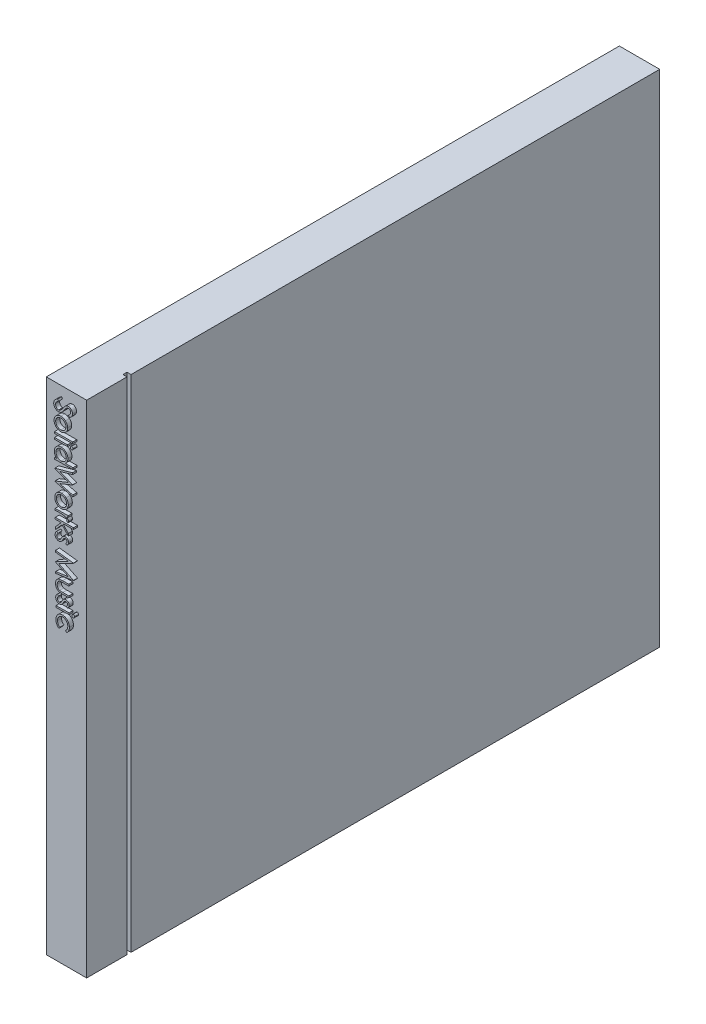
from build123d import *

# Parameters (mm, degrees)
SKETCH1_W           = 142
SKETCH1_H           = 124
BASE_EXTRUDE_DEPTH  = 10
SKETCH2_W           = 0.396761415
SKETCH2_H           = 4.534416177
SKETCH2_W_2         = 0.396761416
SKETCH2_H_2         = 3.230771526
BOSS_EXTRUDE1_DEPTH = 1
SKETCH3_W           = 1
SKETCH3_H           = 124
CUT_EXTRUDE1_DEPTH  = 1


with BuildPart() as part:
    # Sketch1 → Base-Extrude (new body)
    with BuildSketch(Plane(origin=(0, 0, 0), x_dir=(0, 0, -1), z_dir=(1, 0, 0))):
        with Locations((71, 62)):
            Rectangle(SKETCH1_W, SKETCH1_H)
    extrude(amount=BASE_EXTRUDE_DEPTH)

    # Sketch2 → Boss-Extrude1 (add)
    # profile 1 of 17: a face of its own
    with BuildSketch(Plane(origin=(0, 11.766022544, 0), x_dir=(0.010471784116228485, -0.9999451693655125, 0), z_dir=(0, 0, 1))):
        with BuildLine():
            Line((-109.824285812, 4.943446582), (-109.450550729, 5.167510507))
            add(Edge.make_bspline(
                [(-109.450550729, 5.167510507), (-109.415790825, 5.109323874), (-109.349192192, 4.997840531), (-109.238095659, 4.847198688), (-109.122980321, 4.719162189), (-109.00299371, 4.614475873), (-108.878868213, 4.532056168), (-108.749793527, 4.473695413), (-108.616204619, 4.437296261), (-108.525290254, 4.432875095), (-108.479902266, 4.430667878)],
                knots=[0, 0, 0, 0, 1.272034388, 2.437168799, 3.508375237, 4.49857839, 5.41946034, 6.295179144, 7.148887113, 8, 8, 8, 8], degree=3))
            add(Edge.make_bspline(
                [(-108.479902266, 4.430667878), (-108.441139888, 4.431747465), (-108.364293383, 4.433887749), (-108.251162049, 4.454452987), (-108.14129022, 4.486047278), (-108.036942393, 4.531294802), (-107.93955839, 4.586038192), (-107.854160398, 4.652159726), (-107.780333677, 4.72618867), (-107.719943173, 4.808777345), (-107.673610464, 4.89759907), (-107.637999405, 4.988768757), (-107.618237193, 5.083718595), (-107.615260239, 5.147647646), (-107.613757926, 5.179909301)],
                knots=[0, 0, 0, 0, 1.095163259, 2.171163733, 3.241058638, 4.321873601, 5.38011039, 6.391990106, 7.366004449, 8.327778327, 9.272591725, 10.192022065, 11.087607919, 12, 12, 12, 12], degree=3))
            add(Edge.make_bspline(
                [(-107.613757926, 5.179909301), (-107.615620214, 5.216718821), (-107.619405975, 5.291547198), (-107.651403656, 5.401946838), (-107.701739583, 5.511200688), (-107.74817664, 5.578781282), (-107.772285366, 5.613867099)],
                knots=[0, 0, 0, 0, 0.938893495, 1.908633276, 2.914225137, 4, 4, 4, 4], degree=3))
            add(Edge.make_bspline(
                [(-107.772285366, 5.613867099), (-107.79207984, 5.639189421), (-107.833635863, 5.692350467), (-107.905076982, 5.771481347), (-107.988907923, 5.853104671), (-108.082259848, 5.940337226), (-108.188533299, 6.029121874), (-108.304399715, 6.123692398), (-108.432817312, 6.220452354), (-108.522879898, 6.285344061), (-108.56935071, 6.318827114)],
                knots=[0, 0, 0, 0, 0.722233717, 1.516239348, 2.393582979, 3.351407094, 4.387010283, 5.505090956, 6.712668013, 8, 8, 8, 8], degree=3))
            add(Edge.make_bspline(
                [(-108.56935071, 6.318827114), (-108.615865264, 6.351957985), (-108.704797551, 6.415301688), (-108.829166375, 6.509311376), (-108.940380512, 6.595261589), (-109.037945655, 6.673961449), (-109.12181889, 6.745421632), (-109.192661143, 6.808955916), (-109.248667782, 6.86628256), (-109.279811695, 6.90347165), (-109.293794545, 6.920168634)],
                knots=[0, 0, 0, 0, 1.452282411, 2.77665338, 3.964542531, 5.026858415, 5.96415736, 6.766646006, 7.446254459, 8, 8, 8, 8], degree=3))
            add(Edge.make_bspline(
                [(-109.293794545, 6.920168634), (-109.313338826, 6.946191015), (-109.351775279, 6.99736752), (-109.402511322, 7.07735687), (-109.445634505, 7.159238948), (-109.47943958, 7.243233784), (-109.507906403, 7.328162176), (-109.527053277, 7.415132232), (-109.539042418, 7.503753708), (-109.540270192, 7.563391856), (-109.540884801, 7.593246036)],
                knots=[0, 0, 0, 0, 1.068054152, 2.10047183, 3.106115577, 4.101338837, 5.06977816, 6.043150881, 7.020423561, 8, 8, 8, 8], degree=3))
            add(Edge.make_bspline(
                [(-109.540884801, 7.593246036), (-109.539236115, 7.640020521), (-109.535973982, 7.73256972), (-109.50838594, 7.867766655), (-109.464841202, 7.996844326), (-109.40383709, 8.118524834), (-109.325196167, 8.229639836), (-109.234190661, 8.331467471), (-109.125797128, 8.417069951), (-109.006867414, 8.491864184), (-108.876690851, 8.550406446), (-108.740281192, 8.594567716), (-108.597421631, 8.619589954), (-108.500659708, 8.623180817), (-108.451562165, 8.625002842)],
                knots=[0, 0, 0, 0, 1.005424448, 1.989358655, 2.955360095, 3.929531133, 4.905563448, 5.876582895, 6.856512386, 7.866279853, 8.892233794, 9.918561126, 10.94386622, 12, 12, 12, 12], degree=3))
            add(Edge.make_bspline(
                [(-108.451562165, 8.625002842), (-108.399464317, 8.623205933), (-108.295858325, 8.619632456), (-108.143459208, 8.588561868), (-107.996729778, 8.537150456), (-107.878696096, 8.478806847), (-107.786317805, 8.420535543), (-107.715867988, 8.367457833), (-107.644477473, 8.306352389), (-107.571570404, 8.23705645), (-107.498382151, 8.158934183), (-107.423826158, 8.07252062), (-107.347728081, 7.97834385), (-107.298773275, 7.911112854), (-107.273676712, 7.876647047)],
                knots=[0, 0, 0, 0, 1.286793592, 2.559021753, 3.825965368, 5.121522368, 5.803751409, 6.523245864, 7.299691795, 8.125521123, 9.008227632, 9.944561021, 10.946284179, 12, 12, 12, 12], degree=3))
            Line((-107.273676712, 7.876647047), (-107.632356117, 7.604759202))
            add(Edge.make_bspline(
                [(-107.632356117, 7.604759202), (-107.654014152, 7.632660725), (-107.695722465, 7.686392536), (-107.759043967, 7.761640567), (-107.818726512, 7.830377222), (-107.877527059, 7.890080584), (-107.932340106, 7.944020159), (-107.985540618, 7.990200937), (-108.036362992, 8.029075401), (-108.100426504, 8.070562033), (-108.1809121, 8.111686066), (-108.28194527, 8.146484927), (-108.387528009, 8.167396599), (-108.459439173, 8.170161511), (-108.495843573, 8.171561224)],
                knots=[0, 0, 0, 0, 1.181633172, 2.275549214, 3.290209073, 4.226197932, 5.078386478, 5.862611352, 6.581680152, 7.217281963, 8.414376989, 9.595101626, 10.782541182, 12, 12, 12, 12], degree=3))
            add(Edge.make_bspline(
                [(-108.495843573, 8.171561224), (-108.541515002, 8.170030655), (-108.629588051, 8.167079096), (-108.754628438, 8.134843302), (-108.867168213, 8.084087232), (-108.963866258, 8.012952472), (-109.044376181, 7.928673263), (-109.102614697, 7.831689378), (-109.137667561, 7.72459574), (-109.14194497, 7.649890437), (-109.144123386, 7.611844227)],
                knots=[0, 0, 0, 0, 1.14458467, 2.207223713, 3.21896685, 4.227309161, 5.202851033, 6.127160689, 7.046193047, 8, 8, 8, 8], degree=3))
            add(Edge.make_bspline(
                [(-109.144123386, 7.611844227), (-109.143626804, 7.588158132), (-109.142632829, 7.540747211), (-109.128769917, 7.47070326), (-109.110960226, 7.400836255), (-109.082737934, 7.331460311), (-109.043775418, 7.261362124), (-108.992610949, 7.189334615), (-108.928173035, 7.11474293), (-108.878812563, 7.066228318), (-108.852751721, 7.040614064)],
                knots=[0, 0, 0, 0, 0.858281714, 1.717966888, 2.583508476, 3.4729293, 4.427298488, 5.488583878, 6.674047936, 8, 8, 8, 8], degree=3))
            add(Edge.make_bspline(
                [(-108.852751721, 7.040614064), (-108.843074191, 7.031977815), (-108.820082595, 7.011460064), (-108.778049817, 6.97786979), (-108.722543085, 6.93643468), (-108.655011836, 6.885166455), (-108.5742109, 6.825695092), (-108.480131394, 6.758781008), (-108.373822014, 6.682251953), (-108.298383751, 6.628747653), (-108.258495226, 6.600456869)],
                knots=[0, 0, 0, 0, 0.420754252, 0.999615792, 1.744751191, 2.668019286, 3.750313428, 4.999500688, 6.413464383, 8, 8, 8, 8], degree=3))
            add(Edge.make_bspline(
                [(-108.258495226, 6.600456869), (-108.210512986, 6.565541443), (-108.117602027, 6.497932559), (-107.985402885, 6.396354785), (-107.865536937, 6.297010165), (-107.75758334, 6.200533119), (-107.660475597, 6.107655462), (-107.575291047, 6.017259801), (-107.501161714, 5.929993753), (-107.421356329, 5.818112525), (-107.339809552, 5.680704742), (-107.269778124, 5.512353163), (-107.22562018, 5.343347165), (-107.21984563, 5.229755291), (-107.21699651, 5.173709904)],
                knots=[0, 0, 0, 0, 1.163667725, 2.253281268, 3.268753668, 4.215851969, 5.092017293, 5.902905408, 6.650798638, 7.335211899, 8.59617414, 9.77448103, 10.901945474, 12, 12, 12, 12], degree=3))
            add(Edge.make_bspline(
                [(-107.21699651, 5.173709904), (-107.21782658, 5.134074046), (-107.2194706, 5.055572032), (-107.23836861, 4.940302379), (-107.266056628, 4.828347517), (-107.3077879, 4.721091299), (-107.358722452, 4.616571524), (-107.423353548, 4.517529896), (-107.498268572, 4.421774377), (-107.58420602, 4.331858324), (-107.678243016, 4.249315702), (-107.777633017, 4.175889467), (-107.882538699, 4.114666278), (-107.992390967, 4.064707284), (-108.107215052, 4.025633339), (-108.226972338, 3.997322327), (-108.351860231, 3.979946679), (-108.43674511, 3.97814319), (-108.479902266, 3.97722626)],
                knots=[0, 0, 0, 0, 0.983748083, 1.948392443, 2.894712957, 3.844097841, 4.80183111, 5.778335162, 6.776009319, 7.81870978, 8.863265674, 9.881300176, 10.883814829, 11.87499822, 12.874611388, 13.892143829, 14.928324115, 16, 16, 16, 16], degree=3))
            add(Edge.make_bspline(
                [(-108.479902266, 3.97722626), (-108.513294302, 3.977871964), (-108.579657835, 3.979155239), (-108.677817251, 3.990500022), (-108.773993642, 4.006551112), (-108.86698017, 4.032034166), (-108.95797486, 4.062952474), (-109.046581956, 4.101021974), (-109.132844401, 4.146643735), (-109.217245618, 4.198805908), (-109.29957095, 4.259510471), (-109.379048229, 4.330213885), (-109.458285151, 4.408966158), (-109.534942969, 4.49790588), (-109.610572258, 4.595596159), (-109.68368188, 4.702950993), (-109.755785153, 4.819385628), (-109.801025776, 4.901320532), (-109.824285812, 4.943446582)],
                knots=[0, 0, 0, 0, 0.915332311, 1.819136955, 2.706846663, 3.586547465, 4.459518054, 5.340707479, 6.227863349, 7.133153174, 8.059268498, 9.028702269, 10.047606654, 11.120612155, 12.245963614, 13.433783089, 14.680604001, 16, 16, 16, 16], degree=3))
        make_face()
    # profile 2 of 17: a face of its own
    with BuildSketch(Plane(origin=(0, 11.766022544, 0), x_dir=(0.010471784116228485, -0.9999451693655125, 0), z_dir=(0, 0, 1))):
        with BuildLine():
            add(Edge.make_bspline(
                [(-104.862996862, 7.378038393), (-104.802376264, 7.376747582), (-104.683514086, 7.374216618), (-104.509440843, 7.347166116), (-104.343278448, 7.305800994), (-104.184390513, 7.248615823), (-104.034811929, 7.171964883), (-103.89236394, 7.080500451), (-103.757437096, 6.972143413), (-103.676565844, 6.888322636), (-103.635516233, 6.845775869)],
                knots=[0, 0, 0, 0, 1.054011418, 2.066658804, 3.057071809, 4.030435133, 4.997543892, 5.974964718, 6.972108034, 8, 8, 8, 8], degree=3))
            add(Edge.make_bspline(
                [(-103.635516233, 6.845775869), (-103.600170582, 6.80508449), (-103.530163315, 6.724489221), (-103.440396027, 6.593808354), (-103.363063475, 6.458473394), (-103.301089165, 6.316687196), (-103.252223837, 6.169687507), (-103.217530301, 6.016969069), (-103.196894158, 5.85886915), (-103.194111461, 5.751495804), (-103.192702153, 5.697116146)],
                knots=[0, 0, 0, 0, 1.025258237, 2.030674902, 3.01204498, 3.988269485, 4.97094183, 5.956517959, 6.965070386, 8, 8, 8, 8], degree=3))
            add(Edge.make_bspline(
                [(-103.192702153, 5.697116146), (-103.193941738, 5.642421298), (-103.196391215, 5.534341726), (-103.219562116, 5.375159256), (-103.255601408, 5.220807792), (-103.307178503, 5.071933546), (-103.373315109, 4.928081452), (-103.454019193, 4.789879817), (-103.549857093, 4.657055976), (-103.658493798, 4.530737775), (-103.778559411, 4.41431721), (-103.90881148, 4.31284985), (-104.046690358, 4.225917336), (-104.194029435, 4.155892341), (-104.349483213, 4.100680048), (-104.513386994, 4.061901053), (-104.685486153, 4.038454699), (-104.802994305, 4.035443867), (-104.862996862, 4.033906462)],
                knots=[0, 0, 0, 0, 0.998656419, 1.973391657, 2.932242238, 3.890759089, 4.846373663, 5.82037756, 6.809684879, 7.83454468, 8.860553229, 9.859544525, 10.845671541, 11.83227036, 12.833544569, 13.85385346, 14.904124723, 16, 16, 16, 16], degree=3))
            add(Edge.make_bspline(
                [(-104.862996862, 4.033906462), (-104.923293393, 4.035449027), (-105.041387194, 4.038470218), (-105.21409382, 4.06180996), (-105.37829135, 4.100662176), (-105.533948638, 4.156073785), (-105.681921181, 4.225919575), (-105.82059896, 4.312587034), (-105.950956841, 4.414347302), (-106.071047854, 4.530729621), (-106.179677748, 4.657058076), (-106.275517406, 4.789879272), (-106.356221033, 4.928081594), (-106.422357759, 5.071933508), (-106.473934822, 5.220807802), (-106.509974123, 5.375159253), (-106.533145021, 5.534341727), (-106.535594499, 5.642421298), (-106.536834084, 5.697116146)],
                knots=[0, 0, 0, 0, 1.099876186, 2.154163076, 3.173186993, 4.173200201, 5.163417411, 6.152872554, 7.150605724, 8.17532212, 9.198891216, 10.186952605, 11.159729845, 12.11414092, 13.071450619, 14.029093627, 15.002601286, 16, 16, 16, 16], degree=3))
            add(Edge.make_bspline(
                [(-106.536834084, 5.697116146), (-106.535415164, 5.751200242), (-106.532605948, 5.858277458), (-106.511990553, 6.016080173), (-106.477432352, 6.168540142), (-106.428508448, 6.314972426), (-106.3659629, 6.456137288), (-106.289717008, 6.591806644), (-106.199034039, 6.72189659), (-106.129305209, 6.802387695), (-106.094020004, 6.843118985)],
                knots=[0, 0, 0, 0, 1.031353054, 2.041901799, 3.029428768, 4.008703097, 4.981709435, 5.96992636, 6.972712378, 8, 8, 8, 8], degree=3))
            add(Edge.make_bspline(
                [(-106.094020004, 6.843118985), (-106.053032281, 6.886034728), (-105.972422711, 6.970436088), (-105.836824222, 7.078477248), (-105.694726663, 7.171844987), (-105.54349507, 7.246972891), (-105.384737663, 7.306137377), (-105.217723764, 7.347272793), (-105.043059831, 7.374119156), (-104.923616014, 7.376718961), (-104.862996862, 7.378038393)],
                knots=[0, 0, 0, 0, 1.027980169, 2.021703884, 2.998553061, 3.971491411, 4.943284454, 5.930300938, 6.949603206, 8, 8, 8, 8], degree=3))
        make_face()
        with BuildLine():
            add(Edge.make_bspline(
                [(-104.864768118, 6.981276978), (-104.907636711, 6.980058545), (-104.992267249, 6.977653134), (-105.116839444, 6.959357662), (-105.236763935, 6.930371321), (-105.352268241, 6.88918722), (-105.462962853, 6.836009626), (-105.568953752, 6.770693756), (-105.670552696, 6.694104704), (-105.765772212, 6.60636232), (-105.853160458, 6.510515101), (-105.929553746, 6.408390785), (-105.994511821, 6.301645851), (-106.048625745, 6.190169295), (-106.08892959, 6.072831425), (-106.118200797, 5.950961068), (-106.136479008, 5.824309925), (-106.138861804, 5.738211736), (-106.140072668, 5.694459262)],
                knots=[0, 0, 0, 0, 1.021534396, 2.016698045, 2.994645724, 3.958388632, 4.93408049, 5.916473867, 6.921342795, 7.962252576, 8.998418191, 10.008913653, 10.997312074, 11.973003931, 12.956656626, 13.948281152, 14.957379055, 16, 16, 16, 16], degree=3))
            add(Edge.make_bspline(
                [(-106.140072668, 5.694459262), (-106.138042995, 5.637930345), (-106.134014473, 5.525731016), (-106.101254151, 5.360495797), (-106.04645039, 5.201865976), (-105.972445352, 5.050771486), (-105.879721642, 4.910974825), (-105.770474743, 4.786337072), (-105.645877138, 4.678733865), (-105.507414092, 4.589452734), (-105.357913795, 4.518514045), (-105.199695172, 4.468241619), (-105.03467523, 4.435561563), (-104.92189949, 4.432313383), (-104.864768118, 4.430667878)],
                knots=[0, 0, 0, 0, 1.016792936, 2.018143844, 3.017858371, 4.030088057, 5.03801393, 6.028138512, 7.003788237, 7.991172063, 8.984598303, 9.972568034, 10.972917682, 12, 12, 12, 12], degree=3))
            add(Edge.make_bspline(
                [(-104.864768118, 4.430667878), (-104.807640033, 4.43232297), (-104.694870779, 4.435590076), (-104.530080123, 4.468077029), (-104.372293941, 4.518734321), (-104.222948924, 4.589372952), (-104.084548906, 4.679072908), (-103.95905519, 4.78572946), (-103.850741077, 4.91130494), (-103.75810909, 5.050956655), (-103.682892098, 5.201631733), (-103.628344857, 5.360525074), (-103.595505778, 5.52572356), (-103.591487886, 5.637927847), (-103.589463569, 5.694459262)],
                knots=[0, 0, 0, 0, 1.02726834, 2.027799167, 3.010890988, 4.004497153, 4.992059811, 5.971914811, 6.958719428, 7.966827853, 8.981595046, 9.981490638, 10.983022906, 12, 12, 12, 12], degree=3))
            add(Edge.make_bspline(
                [(-103.589463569, 5.694459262), (-103.590674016, 5.738211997), (-103.593055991, 5.824310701), (-103.61134017, 5.950958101), (-103.640589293, 6.07284231), (-103.680974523, 6.190129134), (-103.734853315, 6.301934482), (-103.801064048, 6.408077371), (-103.877145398, 6.51086887), (-103.965588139, 6.606052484), (-104.060708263, 6.694138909), (-104.162348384, 6.770723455), (-104.268182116, 6.835722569), (-104.378555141, 6.889642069), (-104.494074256, 6.929996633), (-104.613830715, 6.959525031), (-104.737871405, 6.977575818), (-104.822198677, 6.980035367), (-104.864768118, 6.981276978)],
                knots=[0, 0, 0, 0, 1.042956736, 2.052379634, 3.044323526, 4.02829302, 5.004299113, 5.996692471, 7.007513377, 8.048758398, 9.090003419, 10.095195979, 11.07790575, 12.047570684, 13.018257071, 13.989683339, 14.985167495, 16, 16, 16, 16], degree=3))
        make_face(mode=Mode.SUBTRACT)
    # profile 3 of 17: a face of its own
    with BuildSketch(Plane(origin=(0, 11.766022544, 0), x_dir=(0.010471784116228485, -0.9999451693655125, 0), z_dir=(0, 0, 1))):
        with Locations((-102.257478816, 6.357794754)):
            Rectangle(SKETCH2_W, SKETCH2_H)
    # profile 4 of 17: a face of its own
    with BuildSketch(Plane(origin=(0, 11.766022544, 0), x_dir=(0.010471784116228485, -0.9999451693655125, 0), z_dir=(0, 0, 1))):
        with BuildLine():
            add(Edge.make_bspline(
                [(-101.012285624, 8.681683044), (-100.987664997, 8.680540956), (-100.939453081, 8.678304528), (-100.86973522, 8.659153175), (-100.806252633, 8.626690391), (-100.749943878, 8.583137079), (-100.701625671, 8.531916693), (-100.667797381, 8.472218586), (-100.646055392, 8.407723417), (-100.643429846, 8.362735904), (-100.642093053, 8.339830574)],
                knots=[0, 0, 0, 0, 1.055194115, 2.066272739, 3.074728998, 4.095836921, 5.109056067, 6.073838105, 7.019297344, 8, 8, 8, 8], degree=3))
            add(Edge.make_bspline(
                [(-100.642093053, 8.339830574), (-100.643459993, 8.317519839), (-100.646162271, 8.273414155), (-100.667780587, 8.210037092), (-100.701913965, 8.151168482), (-100.749912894, 8.100047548), (-100.806260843, 8.056518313), (-100.869733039, 8.024049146), (-100.939453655, 8.004899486), (-100.987665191, 8.002662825), (-101.012285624, 8.001520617)],
                knots=[0, 0, 0, 0, 0.96129708, 1.900370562, 2.859976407, 3.87933698, 4.906634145, 5.921202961, 6.938410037, 8, 8, 8, 8], degree=3))
            add(Edge.make_bspline(
                [(-101.012285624, 8.001520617), (-101.036624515, 8.002619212), (-101.083996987, 8.004757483), (-101.152670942, 8.024424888), (-101.215612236, 8.056529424), (-101.27203081, 8.099762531), (-101.319058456, 8.151482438), (-101.353287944, 8.210001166), (-101.374856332, 8.273423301), (-101.377565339, 8.317522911), (-101.378935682, 8.339830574)],
                knots=[0, 0, 0, 0, 1.054934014, 2.053291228, 3.073705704, 4.106921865, 5.123545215, 6.088680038, 7.033164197, 8, 8, 8, 8], degree=3))
            add(Edge.make_bspline(
                [(-101.378935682, 8.339830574), (-101.377595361, 8.362732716), (-101.374962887, 8.407713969), (-101.353271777, 8.472255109), (-101.319343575, 8.531600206), (-101.271999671, 8.583421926), (-101.215620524, 8.626679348), (-101.152668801, 8.658777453), (-101.083997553, 8.678446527), (-101.036624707, 8.680584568), (-101.012285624, 8.681683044)],
                knots=[0, 0, 0, 0, 0.98631895, 1.937192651, 2.907499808, 3.917963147, 4.944918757, 5.95915025, 6.951458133, 8, 8, 8, 8], degree=3))
        make_face()
    # profile 5 of 17: a face of its own
    with BuildSketch(Plane(origin=(0, 11.766022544, 0), x_dir=(0.010471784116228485, -0.9999451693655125, 0), z_dir=(0, 0, 1))):
        with Locations((-101.010514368, 5.705972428)):
            Rectangle(SKETCH2_W_2, SKETCH2_H_2)
    # profile 6 of 17: a face of its own
    with BuildSketch(Plane(origin=(0, 11.766022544, 0), x_dir=(0.010471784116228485, -0.9999451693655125, 0), z_dir=(0, 0, 1))):
        with BuildLine():
            Line((-96.561118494, 8.625002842), (-96.561118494, 4.090586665))
            Line((-96.561118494, 4.090586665), (-96.95787991, 4.090586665))
            Line((-96.95787991, 4.090586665), (-96.95787991, 4.649418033))
            add(Edge.make_bspline(
                [(-96.95787991, 4.649418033), (-97.002619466, 4.598841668), (-97.089929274, 4.500141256), (-97.235749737, 4.371195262), (-97.390320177, 4.264612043), (-97.552890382, 4.178527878), (-97.723313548, 4.113864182), (-97.901211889, 4.067902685), (-98.086657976, 4.038352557), (-98.213292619, 4.03540179), (-98.277465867, 4.033906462)],
                knots=[0, 0, 0, 0, 1.074387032, 2.096679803, 3.090159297, 4.057316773, 5.018401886, 5.985159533, 6.978961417, 8, 8, 8, 8], degree=3))
            add(Edge.make_bspline(
                [(-98.277465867, 4.033906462), (-98.334520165, 4.035455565), (-98.447033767, 4.038510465), (-98.612544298, 4.062210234), (-98.771818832, 4.100269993), (-98.925007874, 4.15319747), (-99.071120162, 4.223404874), (-99.211406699, 4.307457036), (-99.345140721, 4.407550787), (-99.470283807, 4.521977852), (-99.58552431, 4.646266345), (-99.68665441, 4.778829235), (-99.77097415, 4.919093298), (-99.841483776, 5.065282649), (-99.895794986, 5.218522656), (-99.933656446, 5.378283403), (-99.957328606, 5.544375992), (-99.960382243, 5.657478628), (-99.961930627, 5.714828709)],
                knots=[0, 0, 0, 0, 1.033919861, 2.038935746, 3.024066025, 3.998881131, 4.97069526, 5.957263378, 6.95902576, 7.993208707, 9.027059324, 10.027763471, 11.009749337, 11.988697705, 12.965288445, 13.950418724, 14.960734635, 16, 16, 16, 16], degree=3))
            add(Edge.make_bspline(
                [(-99.961930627, 5.714828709), (-99.960347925, 5.770993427), (-99.957219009, 5.882028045), (-99.933909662, 6.045327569), (-99.894712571, 6.202613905), (-99.839704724, 6.353380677), (-99.769167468, 6.497810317), (-99.683363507, 6.636004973), (-99.582286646, 6.768345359), (-99.465757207, 6.891719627), (-99.339523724, 7.00568259), (-99.20448102, 7.104725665), (-99.063988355, 7.190262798), (-98.915866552, 7.258035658), (-98.762307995, 7.31286825), (-98.601945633, 7.350804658), (-98.435446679, 7.373159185), (-98.322405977, 7.376396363), (-98.265067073, 7.378038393)],
                knots=[0, 0, 0, 0, 1.020392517, 2.01726096, 2.990465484, 3.961182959, 4.928053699, 5.906110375, 6.912531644, 7.948652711, 8.985773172, 9.998621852, 10.987621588, 11.969261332, 12.953316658, 13.946091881, 14.958173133, 16, 16, 16, 16], degree=3))
            add(Edge.make_bspline(
                [(-98.265067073, 7.378038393), (-98.199108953, 7.376058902), (-98.069640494, 7.372173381), (-97.880294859, 7.339702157), (-97.701194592, 7.285180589), (-97.531308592, 7.210538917), (-97.371649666, 7.113527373), (-97.221047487, 6.996367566), (-97.082121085, 6.855743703), (-96.999925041, 6.750129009), (-96.95787991, 6.69610471)],
                knots=[0, 0, 0, 0, 1.031072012, 2.023879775, 2.993683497, 3.952812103, 4.918022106, 5.908088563, 6.929940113, 8, 8, 8, 8], degree=3))
            Line((-96.95787991, 6.69610471), (-96.95787991, 8.625002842))
            Line((-96.95787991, 8.625002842), (-96.561118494, 8.625002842))
        make_face()
        with BuildLine():
            add(Edge.make_bspline(
                [(-98.259753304, 6.981276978), (-98.317750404, 6.979213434), (-98.432227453, 6.975140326), (-98.600283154, 6.943342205), (-98.761100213, 6.890435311), (-98.91387431, 6.818079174), (-99.056192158, 6.727095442), (-99.183384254, 6.617047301), (-99.296490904, 6.490937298), (-99.3916172, 6.349334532), (-99.469163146, 6.19753052), (-99.523689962, 6.038846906), (-99.559651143, 5.876145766), (-99.563325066, 5.765792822), (-99.565169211, 5.710400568)],
                knots=[0, 0, 0, 0, 1.031046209, 2.035121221, 3.029706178, 4.034933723, 5.034054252, 6.02443088, 7.017295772, 8.038157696, 9.050218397, 10.03989886, 11.016116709, 12, 12, 12, 12], degree=3))
            add(Edge.make_bspline(
                [(-99.565169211, 5.710400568), (-99.562813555, 5.655339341), (-99.558111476, 5.545432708), (-99.524321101, 5.382509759), (-99.467630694, 5.223788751), (-99.390272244, 5.070616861), (-99.29340486, 4.928405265), (-99.181124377, 4.799891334), (-99.052344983, 4.689378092), (-98.909699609, 4.596867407), (-98.757352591, 4.522135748), (-98.597141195, 4.470137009), (-98.432077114, 4.436565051), (-98.319842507, 4.432643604), (-98.263295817, 4.430667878)],
                knots=[0, 0, 0, 0, 0.979072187, 1.954306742, 2.945804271, 3.96968567, 4.997920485, 5.998718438, 6.996577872, 8.005894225, 9.015743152, 10.005417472, 10.995077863, 12, 12, 12, 12], degree=3))
            add(Edge.make_bspline(
                [(-98.263295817, 4.430667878), (-98.205889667, 4.432764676), (-98.091714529, 4.436934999), (-97.923160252, 4.468869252), (-97.759587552, 4.521629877), (-97.603224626, 4.594765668), (-97.457562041, 4.685406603), (-97.326827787, 4.791520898), (-97.216281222, 4.914935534), (-97.122564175, 5.050569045), (-97.049079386, 5.199257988), (-96.995551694, 5.357574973), (-96.963904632, 5.525525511), (-96.959915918, 5.64030108), (-96.95787991, 5.698887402)],
                knots=[0, 0, 0, 0, 1.01762866, 2.023962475, 3.030623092, 4.058876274, 5.077231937, 6.066672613, 7.034107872, 8.005628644, 8.981990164, 9.965428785, 10.961468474, 12, 12, 12, 12], degree=3))
            add(Edge.make_bspline(
                [(-96.95787991, 5.698887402), (-96.959092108, 5.743524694), (-96.961478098, 5.831385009), (-96.979706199, 5.960388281), (-97.008701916, 6.083841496), (-97.049560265, 6.20187445), (-97.103233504, 6.313834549), (-97.16796757, 6.42052569), (-97.244900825, 6.521392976), (-97.332794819, 6.615047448), (-97.429003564, 6.700470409), (-97.530807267, 6.77672003), (-97.639412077, 6.839358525), (-97.752991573, 6.891200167), (-97.871742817, 6.93245386), (-97.996632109, 6.959975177), (-98.126331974, 6.978872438), (-98.214811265, 6.980467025), (-98.259753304, 6.981276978)],
                knots=[0, 0, 0, 0, 1.050140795, 2.067009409, 3.05949893, 4.030605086, 5.00011959, 5.97591094, 6.962425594, 7.979863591, 8.993523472, 9.986985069, 10.967611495, 11.937549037, 12.921786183, 13.919465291, 14.943216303, 16, 16, 16, 16], degree=3))
        make_face(mode=Mode.SUBTRACT)
    # profile 7 of 17: a face of its own
    with BuildSketch(Plane(origin=(0, 11.766022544, 0), x_dir=(0.010471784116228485, -0.9999451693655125, 0), z_dir=(0, 0, 1))):
        Polygon((-95.824275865, 8.511642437), (-95.414230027, 8.511642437), (-94.548971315, 5.269357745), (-93.2621536, 8.511642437), (-93.204587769, 8.511642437), (-91.941682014, 5.291498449), (-91.071995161, 8.511642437), (-90.666377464, 8.511642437), (-91.858432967, 4.090586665), (-91.915113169, 4.090586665), (-93.245326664, 7.471914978), (-94.591481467, 4.090586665), (-94.648161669, 4.090586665), align=None)
    # profile 8 of 17: a face of its own
    with BuildSketch(Plane(origin=(0, 11.766022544, 0), x_dir=(0.010471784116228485, -0.9999451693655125, 0), z_dir=(0, 0, 1))):
        with BuildLine():
            add(Edge.make_bspline(
                [(-88.42573822, 7.378038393), (-88.365117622, 7.376747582), (-88.246255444, 7.374216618), (-88.072182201, 7.347166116), (-87.906019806, 7.305800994), (-87.747131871, 7.248615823), (-87.597553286, 7.171964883), (-87.455105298, 7.080500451), (-87.320178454, 6.972143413), (-87.239307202, 6.888322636), (-87.198257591, 6.845775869)],
                knots=[0, 0, 0, 0, 1.054011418, 2.066658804, 3.057071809, 4.030435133, 4.997543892, 5.974964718, 6.972108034, 8, 8, 8, 8], degree=3))
            add(Edge.make_bspline(
                [(-87.198257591, 6.845775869), (-87.162911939, 6.80508449), (-87.092904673, 6.724489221), (-87.003137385, 6.593808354), (-86.925804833, 6.458473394), (-86.863830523, 6.316687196), (-86.814965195, 6.169687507), (-86.780271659, 6.016969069), (-86.759635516, 5.85886915), (-86.756852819, 5.751495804), (-86.755443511, 5.697116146)],
                knots=[0, 0, 0, 0, 1.025258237, 2.030674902, 3.01204498, 3.988269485, 4.97094183, 5.956517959, 6.965070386, 8, 8, 8, 8], degree=3))
            add(Edge.make_bspline(
                [(-86.755443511, 5.697116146), (-86.756683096, 5.642421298), (-86.759132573, 5.534341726), (-86.782303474, 5.375159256), (-86.818342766, 5.220807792), (-86.869919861, 5.071933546), (-86.936056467, 4.928081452), (-87.016760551, 4.789879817), (-87.112598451, 4.657055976), (-87.221235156, 4.530737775), (-87.341300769, 4.41431721), (-87.471552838, 4.31284985), (-87.609431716, 4.225917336), (-87.756770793, 4.155892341), (-87.912224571, 4.100680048), (-88.076128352, 4.061901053), (-88.248227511, 4.038454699), (-88.365735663, 4.035443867), (-88.42573822, 4.033906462)],
                knots=[0, 0, 0, 0, 0.998656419, 1.973391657, 2.932242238, 3.890759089, 4.846373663, 5.82037756, 6.809684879, 7.83454468, 8.860553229, 9.859544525, 10.845671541, 11.83227036, 12.833544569, 13.85385346, 14.904124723, 16, 16, 16, 16], degree=3))
            add(Edge.make_bspline(
                [(-88.42573822, 4.033906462), (-88.486034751, 4.035449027), (-88.604128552, 4.038470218), (-88.776835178, 4.06180996), (-88.941032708, 4.100662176), (-89.096689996, 4.156073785), (-89.244662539, 4.225919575), (-89.383340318, 4.312587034), (-89.513698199, 4.414347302), (-89.633789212, 4.530729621), (-89.742419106, 4.657058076), (-89.838258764, 4.789879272), (-89.918962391, 4.928081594), (-89.985099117, 5.071933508), (-90.03667618, 5.220807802), (-90.072715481, 5.375159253), (-90.095886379, 5.534341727), (-90.098335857, 5.642421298), (-90.099575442, 5.697116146)],
                knots=[0, 0, 0, 0, 1.099876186, 2.154163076, 3.173186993, 4.173200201, 5.163417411, 6.152872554, 7.150605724, 8.17532212, 9.198891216, 10.186952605, 11.159729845, 12.11414092, 13.071450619, 14.029093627, 15.002601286, 16, 16, 16, 16], degree=3))
            add(Edge.make_bspline(
                [(-90.099575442, 5.697116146), (-90.098156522, 5.751200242), (-90.095347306, 5.858277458), (-90.074731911, 6.016080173), (-90.04017371, 6.168540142), (-89.991249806, 6.314972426), (-89.928704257, 6.456137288), (-89.852458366, 6.591806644), (-89.761775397, 6.72189659), (-89.692046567, 6.802387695), (-89.656761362, 6.843118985)],
                knots=[0, 0, 0, 0, 1.031353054, 2.041901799, 3.029428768, 4.008703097, 4.981709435, 5.96992636, 6.972712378, 8, 8, 8, 8], degree=3))
            add(Edge.make_bspline(
                [(-89.656761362, 6.843118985), (-89.615773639, 6.886034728), (-89.535164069, 6.970436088), (-89.39956558, 7.078477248), (-89.257468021, 7.171844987), (-89.106236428, 7.246972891), (-88.947479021, 7.306137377), (-88.780465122, 7.347272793), (-88.605801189, 7.374119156), (-88.486357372, 7.376718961), (-88.42573822, 7.378038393)],
                knots=[0, 0, 0, 0, 1.027980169, 2.021703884, 2.998553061, 3.971491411, 4.943284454, 5.930300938, 6.949603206, 8, 8, 8, 8], degree=3))
        make_face()
        with BuildLine():
            add(Edge.make_bspline(
                [(-88.427509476, 6.981276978), (-88.470378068, 6.980058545), (-88.555008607, 6.977653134), (-88.679580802, 6.959357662), (-88.799505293, 6.930371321), (-88.915009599, 6.88918722), (-89.025704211, 6.836009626), (-89.13169511, 6.770693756), (-89.233294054, 6.694104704), (-89.32851357, 6.60636232), (-89.415901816, 6.510515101), (-89.492295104, 6.408390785), (-89.557253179, 6.301645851), (-89.611367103, 6.190169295), (-89.651670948, 6.072831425), (-89.680942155, 5.950961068), (-89.699220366, 5.824309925), (-89.701603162, 5.738211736), (-89.702814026, 5.694459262)],
                knots=[0, 0, 0, 0, 1.021534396, 2.016698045, 2.994645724, 3.958388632, 4.93408049, 5.916473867, 6.921342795, 7.962252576, 8.998418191, 10.008913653, 10.997312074, 11.973003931, 12.956656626, 13.948281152, 14.957379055, 16, 16, 16, 16], degree=3))
            add(Edge.make_bspline(
                [(-89.702814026, 5.694459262), (-89.700784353, 5.637930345), (-89.696755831, 5.525731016), (-89.663995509, 5.360495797), (-89.609191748, 5.201865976), (-89.53518671, 5.050771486), (-89.442463, 4.910974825), (-89.333216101, 4.786337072), (-89.208618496, 4.678733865), (-89.07015545, 4.589452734), (-88.920655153, 4.518514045), (-88.76243653, 4.468241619), (-88.597416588, 4.435561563), (-88.484640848, 4.432313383), (-88.427509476, 4.430667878)],
                knots=[0, 0, 0, 0, 1.016792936, 2.018143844, 3.017858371, 4.030088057, 5.03801393, 6.028138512, 7.003788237, 7.991172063, 8.984598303, 9.972568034, 10.972917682, 12, 12, 12, 12], degree=3))
            add(Edge.make_bspline(
                [(-88.427509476, 4.430667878), (-88.370381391, 4.43232297), (-88.257612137, 4.435590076), (-88.092821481, 4.468077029), (-87.935035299, 4.518734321), (-87.785690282, 4.589372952), (-87.647290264, 4.679072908), (-87.521796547, 4.78572946), (-87.413482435, 4.91130494), (-87.320850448, 5.050956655), (-87.245633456, 5.201631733), (-87.191086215, 5.360525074), (-87.158247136, 5.52572356), (-87.154229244, 5.637927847), (-87.152204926, 5.694459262)],
                knots=[0, 0, 0, 0, 1.02726834, 2.027799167, 3.010890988, 4.004497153, 4.992059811, 5.971914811, 6.958719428, 7.966827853, 8.981595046, 9.981490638, 10.983022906, 12, 12, 12, 12], degree=3))
            add(Edge.make_bspline(
                [(-87.152204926, 5.694459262), (-87.153415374, 5.738211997), (-87.155797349, 5.824310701), (-87.174081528, 5.950958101), (-87.203330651, 6.07284231), (-87.24371588, 6.190129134), (-87.297594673, 6.301934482), (-87.363805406, 6.408077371), (-87.439886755, 6.51086887), (-87.528329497, 6.606052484), (-87.623449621, 6.694138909), (-87.725089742, 6.770723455), (-87.830923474, 6.835722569), (-87.941296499, 6.889642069), (-88.056815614, 6.929996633), (-88.176572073, 6.959525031), (-88.300612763, 6.977575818), (-88.384940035, 6.980035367), (-88.427509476, 6.981276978)],
                knots=[0, 0, 0, 0, 1.042956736, 2.052379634, 3.044323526, 4.02829302, 5.004299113, 5.996692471, 7.007513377, 8.048758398, 9.090003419, 10.095195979, 11.07790575, 12.047570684, 13.018257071, 13.989683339, 14.985167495, 16, 16, 16, 16], degree=3))
        make_face(mode=Mode.SUBTRACT)
    # profile 9 of 17: a face of its own
    with BuildSketch(Plane(origin=(0, 11.766022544, 0), x_dir=(0.010471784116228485, -0.9999451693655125, 0), z_dir=(0, 0, 1))):
        with BuildLine():
            Line((-86.075281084, 7.321358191), (-85.678519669, 7.321358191))
            Line((-85.678519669, 7.321358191), (-85.678519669, 6.845775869))
            add(Edge.make_bspline(
                [(-85.678519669, 6.845775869), (-85.649228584, 6.890056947), (-85.593209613, 6.974744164), (-85.500098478, 7.086747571), (-85.404725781, 7.179482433), (-85.306634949, 7.253381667), (-85.205104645, 7.308724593), (-85.102363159, 7.349263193), (-84.99679407, 7.373234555), (-84.925852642, 7.376434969), (-84.890310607, 7.378038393)],
                knots=[0, 0, 0, 0, 1.2804753, 2.448899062, 3.506932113, 4.484331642, 5.4025378, 6.288909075, 7.142734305, 8, 8, 8, 8], degree=3))
            add(Edge.make_bspline(
                [(-84.890310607, 7.378038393), (-84.862740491, 7.376534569), (-84.806013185, 7.373440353), (-84.720140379, 7.351700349), (-84.631664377, 7.316991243), (-84.574642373, 7.284350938), (-84.544915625, 7.267334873)],
                knots=[0, 0, 0, 0, 0.901110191, 1.854092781, 2.881294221, 4, 4, 4, 4], degree=3))
            Line((-84.544915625, 7.267334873), (-84.762780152, 6.923711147))
            add(Edge.make_bspline(
                [(-84.762780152, 6.923711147), (-84.781865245, 6.932225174), (-84.818092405, 6.948386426), (-84.871087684, 6.967513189), (-84.919948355, 6.978775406), (-84.951077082, 6.980481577), (-84.965589, 6.981276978)],
                knots=[0, 0, 0, 0, 1.180555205, 2.24091978, 3.179933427, 4, 4, 4, 4], degree=3))
            add(Edge.make_bspline(
                [(-84.965589, 6.981276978), (-84.997427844, 6.979154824), (-85.062369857, 6.974826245), (-85.157718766, 6.940798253), (-85.250241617, 6.885818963), (-85.323721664, 6.824844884), (-85.380617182, 6.766047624), (-85.42121539, 6.714702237), (-85.458456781, 6.657129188), (-85.494040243, 6.5943127), (-85.526460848, 6.525180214), (-85.556719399, 6.450422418), (-85.584077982, 6.369952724), (-85.599678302, 6.313890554), (-85.607669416, 6.285173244)],
                knots=[0, 0, 0, 0, 1.125678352, 2.296057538, 3.5422874, 4.923748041, 5.663163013, 6.437101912, 7.23742474, 8.08941207, 8.991984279, 9.93940061, 10.944477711, 12, 12, 12, 12], degree=3))
            add(Edge.make_bspline(
                [(-85.607669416, 6.285173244), (-85.61364718, 6.259559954), (-85.626887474, 6.202828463), (-85.639761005, 6.107651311), (-85.652480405, 5.995200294), (-85.661444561, 5.8651624), (-85.669753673, 5.717862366), (-85.674440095, 5.553075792), (-85.678359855, 5.370633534), (-85.678464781, 5.243086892), (-85.678519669, 5.176366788)],
                knots=[0, 0, 0, 0, 0.566838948, 1.255505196, 2.06880316, 3.007127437, 4.065329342, 5.249902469, 6.561414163, 8, 8, 8, 8], degree=3))
            Line((-85.678519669, 5.176366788), (-85.678519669, 4.090586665))
            Line((-85.678519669, 4.090586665), (-86.075281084, 4.090586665))
            Line((-86.075281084, 4.090586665), (-86.075281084, 7.321358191))
        make_face()
    # profile 10 of 17: a face of its own
    with BuildSketch(Plane(origin=(0, 11.766022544, 0), x_dir=(0.010471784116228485, -0.9999451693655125, 0), z_dir=(0, 0, 1))):
        Polygon((-84.148154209, 8.625002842), (-83.751392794, 8.625002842), (-83.751392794, 6.003543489), (-82.281250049, 7.321358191), (-81.710905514, 7.321358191), (-83.416625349, 5.790992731), (-81.540864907, 4.090586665), (-82.110323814, 4.090586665), (-83.751392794, 5.579327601), (-83.751392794, 4.090586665), (-84.148154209, 4.090586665), align=None)
    # profile 11 of 17: a face of its own
    with BuildSketch(Plane(origin=(0, 11.766022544, 0), x_dir=(0.010471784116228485, -0.9999451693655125, 0), z_dir=(0, 0, 1))):
        with BuildLine():
            Line((-79.55705783, 6.918397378), (-79.82628879, 6.641195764))
            add(Edge.make_bspline(
                [(-79.82628879, 6.641195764), (-79.849518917, 6.668117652), (-79.894303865, 6.720019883), (-79.965333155, 6.789414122), (-80.036099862, 6.847692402), (-80.105635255, 6.89689529), (-80.175687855, 6.934094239), (-80.245435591, 6.961245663), (-80.314950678, 6.978047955), (-80.361417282, 6.980213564), (-80.384234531, 6.981276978)],
                knots=[0, 0, 0, 0, 1.26578478, 2.440284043, 3.530471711, 4.527705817, 5.468200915, 6.346673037, 7.188140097, 8, 8, 8, 8], degree=3))
            add(Edge.make_bspline(
                [(-80.384234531, 6.981276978), (-80.412200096, 6.979919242), (-80.46723237, 6.977247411), (-80.546086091, 6.950577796), (-80.619286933, 6.909640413), (-80.682643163, 6.851574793), (-80.736311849, 6.784925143), (-80.775487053, 6.710403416), (-80.799444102, 6.630258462), (-80.802481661, 6.57464176), (-80.804022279, 6.546433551)],
                knots=[0, 0, 0, 0, 0.99966794, 1.967205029, 2.953328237, 3.988086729, 5.028030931, 6.008226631, 6.989793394, 8, 8, 8, 8], degree=3))
            add(Edge.make_bspline(
                [(-80.804022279, 6.546433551), (-80.802619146, 6.52090253), (-80.799816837, 6.469912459), (-80.778031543, 6.394693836), (-80.743337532, 6.321358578), (-80.710912, 6.27643698), (-80.694204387, 6.25329063)],
                knots=[0, 0, 0, 0, 0.960159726, 1.917612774, 2.927026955, 4, 4, 4, 4], degree=3))
            add(Edge.make_bspline(
                [(-80.694204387, 6.25329063), (-80.68414523, 6.240931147), (-80.662735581, 6.214625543), (-80.622556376, 6.178115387), (-80.577054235, 6.137767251), (-80.522334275, 6.097425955), (-80.460753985, 6.054943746), (-80.390977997, 6.011993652), (-80.315220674, 5.965301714), (-80.260984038, 5.935687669), (-80.232792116, 5.920294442)],
                knots=[0, 0, 0, 0, 0.66740084, 1.420478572, 2.27185888, 3.217733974, 4.268547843, 5.408967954, 6.65319498, 8, 8, 8, 8], degree=3))
            add(Edge.make_bspline(
                [(-80.232792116, 5.920294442), (-80.198417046, 5.901037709), (-80.132015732, 5.863840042), (-80.037666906, 5.806101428), (-79.952041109, 5.748714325), (-79.874412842, 5.692292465), (-79.806275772, 5.635257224), (-79.74556261, 5.579794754), (-79.693787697, 5.524229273), (-79.664793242, 5.48540847), (-79.650934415, 5.466852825)],
                knots=[0, 0, 0, 0, 1.27191281, 2.456916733, 3.569705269, 4.599008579, 5.553216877, 6.436649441, 7.252746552, 8, 8, 8, 8], degree=3))
            add(Edge.make_bspline(
                [(-79.650934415, 5.466852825), (-79.627931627, 5.429379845), (-79.58215181, 5.35480166), (-79.534078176, 5.231999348), (-79.506212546, 5.101754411), (-79.502344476, 5.012661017), (-79.500377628, 4.967358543)],
                knots=[0, 0, 0, 0, 0.995354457, 1.980940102, 2.973342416, 4, 4, 4, 4], degree=3))
            add(Edge.make_bspline(
                [(-79.500377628, 4.967358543), (-79.501286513, 4.935439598), (-79.503077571, 4.872539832), (-79.515529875, 4.779906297), (-79.536946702, 4.691315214), (-79.566117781, 4.60580532), (-79.605508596, 4.525015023), (-79.651674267, 4.446906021), (-79.707095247, 4.373167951), (-79.770368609, 4.303897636), (-79.839647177, 4.240631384), (-79.91354972, 4.18502214), (-79.992167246, 4.138822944), (-80.074938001, 4.100593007), (-80.162050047, 4.070190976), (-80.253517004, 4.049143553), (-80.34904813, 4.036546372), (-80.414012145, 4.034797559), (-80.44711413, 4.033906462)],
                knots=[0, 0, 0, 0, 1.032770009, 2.035186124, 3.017557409, 3.978232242, 4.952395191, 5.920591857, 6.910227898, 7.931268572, 8.952309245, 9.941945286, 10.918353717, 11.897095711, 12.887975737, 13.898235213, 14.929059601, 16, 16, 16, 16], degree=3))
            add(Edge.make_bspline(
                [(-80.44711413, 4.033906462), (-80.491788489, 4.035160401), (-80.58051646, 4.037650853), (-80.711745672, 4.061026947), (-80.839982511, 4.097400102), (-80.964256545, 4.147567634), (-81.081788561, 4.210915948), (-81.189322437, 4.286784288), (-81.287231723, 4.372666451), (-81.342960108, 4.438493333), (-81.370824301, 4.471406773)],
                knots=[0, 0, 0, 0, 1.013940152, 2.01379169, 3.017749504, 4.037548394, 5.051665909, 6.043208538, 7.021604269, 8, 8, 8, 8], degree=3))
            Line((-81.370824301, 4.471406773), (-81.107792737, 4.770749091))
            add(Edge.make_bspline(
                [(-81.107792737, 4.770749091), (-81.08281704, 4.743774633), (-81.034397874, 4.691480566), (-80.956964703, 4.62184977), (-80.878169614, 4.563490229), (-80.798799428, 4.514677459), (-80.717679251, 4.477066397), (-80.63526368, 4.450642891), (-80.551720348, 4.433660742), (-80.495608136, 4.431667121), (-80.467483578, 4.430667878)],
                knots=[0, 0, 0, 0, 1.179806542, 2.287233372, 3.337373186, 4.324005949, 5.273901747, 6.200048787, 7.097828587, 8, 8, 8, 8], degree=3))
            add(Edge.make_bspline(
                [(-80.467483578, 4.430667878), (-80.429187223, 4.432399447), (-80.35436257, 4.435782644), (-80.24719143, 4.466498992), (-80.148237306, 4.514663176), (-80.062313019, 4.582980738), (-79.989173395, 4.662503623), (-79.936211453, 4.752079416), (-79.903020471, 4.84907922), (-79.899122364, 4.916320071), (-79.897139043, 4.950531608)],
                knots=[0, 0, 0, 0, 1.072336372, 2.095165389, 3.102688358, 4.141489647, 5.156069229, 6.117746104, 7.042326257, 8, 8, 8, 8], degree=3))
            add(Edge.make_bspline(
                [(-79.897139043, 4.950531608), (-79.898511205, 4.978712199), (-79.901220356, 5.034351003), (-79.922496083, 5.114877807), (-79.956112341, 5.19126011), (-79.989212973, 5.235962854), (-80.006071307, 5.258730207)],
                knots=[0, 0, 0, 0, 1.013901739, 2.00181326, 2.98231254, 4, 4, 4, 4], degree=3))
            add(Edge.make_bspline(
                [(-80.006071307, 5.258730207), (-80.016204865, 5.270143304), (-80.038279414, 5.295005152), (-80.078770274, 5.33091054), (-80.127252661, 5.369611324), (-80.184271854, 5.410451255), (-80.2499428, 5.452891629), (-80.324531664, 5.496709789), (-80.407016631, 5.54398695), (-80.46533747, 5.575338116), (-80.495823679, 5.591726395)],
                knots=[0, 0, 0, 0, 0.615000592, 1.339693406, 2.178160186, 3.116406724, 4.166410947, 5.330106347, 6.604359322, 8, 8, 8, 8], degree=3))
            add(Edge.make_bspline(
                [(-80.495823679, 5.591726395), (-80.528724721, 5.610091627), (-80.592530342, 5.645707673), (-80.682905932, 5.701180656), (-80.76443949, 5.757602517), (-80.8390929, 5.811808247), (-80.904980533, 5.866655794), (-80.961842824, 5.922206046), (-81.011918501, 5.976218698), (-81.039641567, 6.014488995), (-81.052883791, 6.032769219)],
                knots=[0, 0, 0, 0, 1.262093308, 2.447601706, 3.550203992, 4.582594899, 5.537233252, 6.418365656, 7.244515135, 8, 8, 8, 8], degree=3))
            add(Edge.make_bspline(
                [(-81.052883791, 6.032769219), (-81.075785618, 6.069584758), (-81.121597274, 6.143228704), (-81.166079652, 6.266147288), (-81.19665571, 6.395551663), (-81.199387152, 6.484840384), (-81.200783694, 6.530492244)],
                knots=[0, 0, 0, 0, 0.985009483, 1.970363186, 2.962279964, 4, 4, 4, 4], degree=3))
            add(Edge.make_bspline(
                [(-81.200783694, 6.530492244), (-81.20010892, 6.560334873), (-81.198788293, 6.618741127), (-81.188248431, 6.704558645), (-81.169058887, 6.786093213), (-81.144989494, 6.864569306), (-81.111537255, 6.938466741), (-81.071563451, 7.008770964), (-81.024589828, 7.075384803), (-80.970471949, 7.13728354), (-80.910968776, 7.193505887), (-80.8466806, 7.242514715), (-80.77905328, 7.284333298), (-80.707800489, 7.319405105), (-80.632237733, 7.345933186), (-80.552893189, 7.364195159), (-80.46992746, 7.376391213), (-80.413210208, 7.377481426), (-80.384234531, 7.378038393)],
                knots=[0, 0, 0, 0, 1.087655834, 2.128696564, 3.144119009, 4.137814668, 5.115653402, 6.093965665, 7.082169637, 8.081268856, 9.086088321, 10.061021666, 11.022561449, 11.980240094, 12.950172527, 13.934149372, 14.944599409, 16, 16, 16, 16], degree=3))
            add(Edge.make_bspline(
                [(-80.384234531, 7.378038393), (-80.349886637, 7.376643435), (-80.280546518, 7.373827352), (-80.176519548, 7.351462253), (-80.072645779, 7.314662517), (-79.968658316, 7.263837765), (-79.865318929, 7.198069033), (-79.761718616, 7.118579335), (-79.656613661, 7.02589163), (-79.590984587, 6.9550294), (-79.55705783, 6.918397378)],
                knots=[0, 0, 0, 0, 0.845714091, 1.707292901, 2.609013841, 3.555613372, 4.552488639, 5.621697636, 6.770543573, 8, 8, 8, 8], degree=3))
        make_face()
    # profile 12 of 17: a face of its own
    with BuildSketch(Plane(origin=(0, 11.766022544, 0), x_dir=(0.010471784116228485, -0.9999451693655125, 0), z_dir=(0, 0, 1))):
        Polygon((-77.119809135, 4.090586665), (-76.536180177, 8.511642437), (-76.479499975, 8.511642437), (-74.654220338, 4.884109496), (-72.833368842, 8.511642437), (-72.775803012, 8.511642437), (-72.188631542, 4.090586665), (-72.587164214, 4.090586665), (-73.010494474, 7.271763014), (-74.606396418, 4.090586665), (-74.695844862, 4.090586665), (-76.297946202, 7.278848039), (-76.720390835, 4.090586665), align=None)
    # profile 13 of 17: a face of its own
    with BuildSketch(Plane(origin=(0, 11.766022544, 0), x_dir=(0.010471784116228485, -0.9999451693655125, 0), z_dir=(0, 0, 1))):
        with BuildLine():
            Line((-71.451788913, 7.321358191), (-71.055027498, 7.321358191))
            Line((-71.055027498, 7.321358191), (-71.055027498, 5.822875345))
            add(Edge.make_bspline(
                [(-71.055027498, 5.822875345), (-71.054848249, 5.778888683), (-71.054505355, 5.694744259), (-71.052179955, 5.573663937), (-71.046710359, 5.463242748), (-71.039871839, 5.363416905), (-71.031077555, 5.274203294), (-71.020614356, 5.195913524), (-71.008919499, 5.127659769), (-70.997471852, 5.086552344), (-70.992147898, 5.067434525)],
                knots=[0, 0, 0, 0, 1.388932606, 2.656963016, 3.823490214, 4.879454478, 5.816252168, 6.653371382, 7.373723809, 8, 8, 8, 8], degree=3))
            add(Edge.make_bspline(
                [(-70.992147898, 5.067434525), (-70.983607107, 5.043405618), (-70.966703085, 4.99584736), (-70.936041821, 4.927145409), (-70.898111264, 4.863513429), (-70.856604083, 4.802497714), (-70.808731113, 4.745905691), (-70.755098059, 4.693832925), (-70.697500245, 4.644311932), (-70.611914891, 4.585720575), (-70.494871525, 4.522922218), (-70.341204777, 4.468737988), (-70.174588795, 4.436355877), (-70.059433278, 4.43259892), (-70.00024436, 4.430667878)],
                knots=[0, 0, 0, 0, 0.725840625, 1.436591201, 2.137033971, 2.831655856, 3.53531722, 4.242432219, 4.957935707, 5.694543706, 7.190802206, 8.724350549, 10.316345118, 12, 12, 12, 12], degree=3))
            add(Edge.make_bspline(
                [(-70.00024436, 4.430667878), (-69.941060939, 4.432639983), (-69.826551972, 4.436455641), (-69.66176663, 4.467761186), (-69.511133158, 4.520063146), (-69.376163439, 4.593083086), (-69.257469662, 4.682441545), (-69.158558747, 4.787294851), (-69.076949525, 4.904325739), (-69.041316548, 4.99164068), (-69.0233965, 5.035551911)],
                knots=[0, 0, 0, 0, 1.157059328, 2.238695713, 3.266970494, 4.264342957, 5.228770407, 6.160125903, 7.074715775, 8, 8, 8, 8], degree=3))
            add(Edge.make_bspline(
                [(-69.0233965, 5.035551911), (-69.018098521, 5.053193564), (-69.006385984, 5.09219495), (-68.993801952, 5.15835889), (-68.982465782, 5.237261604), (-68.972785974, 5.329419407), (-68.965882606, 5.434591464), (-68.962161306, 5.552744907), (-68.957957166, 5.683508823), (-68.957893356, 5.775047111), (-68.957860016, 5.822875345)],
                knots=[0, 0, 0, 0, 0.557542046, 1.232589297, 2.036731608, 2.971723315, 4.038036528, 5.22795436, 6.551621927, 8, 8, 8, 8], degree=3))
            Line((-68.957860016, 5.822875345), (-68.957860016, 7.321358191))
            Line((-68.957860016, 7.321358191), (-68.5610986, 7.321358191))
            Line((-68.5610986, 7.321358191), (-68.5610986, 5.748482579))
            add(Edge.make_bspline(
                [(-68.5610986, 5.748482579), (-68.561656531, 5.695041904), (-68.562738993, 5.591359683), (-68.569695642, 5.440684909), (-68.581632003, 5.300269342), (-68.599749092, 5.170038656), (-68.621053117, 5.050092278), (-68.648534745, 4.940276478), (-68.681349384, 4.840929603), (-68.718366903, 4.750308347), (-68.762099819, 4.66814379), (-68.808618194, 4.590161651), (-68.862333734, 4.518296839), (-68.918885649, 4.448971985), (-68.981793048, 4.385635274), (-69.049877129, 4.326833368), (-69.122179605, 4.271667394), (-69.200304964, 4.222288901), (-69.283112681, 4.177804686), (-69.370704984, 4.138373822), (-69.464154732, 4.107170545), (-69.562256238, 4.08025179), (-69.665490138, 4.059138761), (-69.773756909, 4.044250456), (-69.887020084, 4.035123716), (-69.964211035, 4.034319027), (-70.003786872, 4.033906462)],
                knots=[0, 0, 0, 0, 1.493040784, 2.896703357, 4.213163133, 5.428574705, 6.569057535, 7.615249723, 8.588095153, 9.490268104, 10.346124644, 11.18633936, 12.024365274, 12.850166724, 13.684164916, 14.514361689, 15.362232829, 16.222528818, 17.093394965, 17.986930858, 18.902426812, 19.842810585, 20.827885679, 21.843828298, 22.894529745, 24, 24, 24, 24], degree=3))
            add(Edge.make_bspline(
                [(-70.003786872, 4.033906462), (-70.043066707, 4.034335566), (-70.12025524, 4.035178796), (-70.233524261, 4.044200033), (-70.342090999, 4.059115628), (-70.44556947, 4.080406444), (-70.544063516, 4.10698213), (-70.637972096, 4.138565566), (-70.726195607, 4.177825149), (-70.809793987, 4.222007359), (-70.888112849, 4.271984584), (-70.96151321, 4.326765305), (-71.029896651, 4.386267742), (-71.093278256, 4.450243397), (-71.150768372, 4.519485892), (-71.20308341, 4.593438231), (-71.251028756, 4.671367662), (-71.294421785, 4.754815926), (-71.331699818, 4.846485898), (-71.364611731, 4.947913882), (-71.391530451, 5.060211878), (-71.413436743, 5.183283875), (-71.431059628, 5.316540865), (-71.443294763, 5.460753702), (-71.450135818, 5.615571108), (-71.451226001, 5.72249736), (-71.451788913, 5.777708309)],
                knots=[0, 0, 0, 0, 1.083640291, 2.129454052, 3.13281866, 4.105697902, 5.042300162, 5.946461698, 6.836384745, 7.703652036, 8.553297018, 9.397182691, 10.228592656, 11.052265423, 11.879314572, 12.708807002, 13.549817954, 14.402308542, 15.300838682, 16.27712199, 17.341985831, 18.484375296, 19.725102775, 21.0496083, 22.476576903, 24, 24, 24, 24], degree=3))
            Line((-71.451788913, 5.777708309), (-71.451788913, 7.321358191))
        make_face()
    # profile 14 of 17: a face of its own
    with BuildSketch(Plane(origin=(0, 11.766022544, 0), x_dir=(0.010471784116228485, -0.9999451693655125, 0), z_dir=(0, 0, 1))):
        with BuildLine():
            Line((-66.123849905, 6.918397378), (-66.393080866, 6.641195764))
            add(Edge.make_bspline(
                [(-66.393080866, 6.641195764), (-66.416310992, 6.668117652), (-66.46109594, 6.720019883), (-66.53212523, 6.789414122), (-66.602891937, 6.847692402), (-66.67242733, 6.89689529), (-66.742479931, 6.934094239), (-66.812227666, 6.961245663), (-66.881742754, 6.978047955), (-66.928209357, 6.980213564), (-66.951026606, 6.981276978)],
                knots=[0, 0, 0, 0, 1.26578478, 2.440284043, 3.530471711, 4.527705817, 5.468200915, 6.346673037, 7.188140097, 8, 8, 8, 8], degree=3))
            add(Edge.make_bspline(
                [(-66.951026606, 6.981276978), (-66.978992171, 6.979919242), (-67.034024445, 6.977247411), (-67.112878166, 6.950577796), (-67.186079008, 6.909640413), (-67.249435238, 6.851574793), (-67.303103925, 6.784925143), (-67.342279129, 6.710403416), (-67.366236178, 6.630258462), (-67.369273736, 6.57464176), (-67.370814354, 6.546433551)],
                knots=[0, 0, 0, 0, 0.99966794, 1.967205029, 2.953328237, 3.988086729, 5.028030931, 6.008226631, 6.989793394, 8, 8, 8, 8], degree=3))
            add(Edge.make_bspline(
                [(-67.370814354, 6.546433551), (-67.369411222, 6.52090253), (-67.366608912, 6.469912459), (-67.344823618, 6.394693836), (-67.310129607, 6.321358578), (-67.277704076, 6.27643698), (-67.260996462, 6.25329063)],
                knots=[0, 0, 0, 0, 0.960159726, 1.917612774, 2.927026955, 4, 4, 4, 4], degree=3))
            add(Edge.make_bspline(
                [(-67.260996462, 6.25329063), (-67.250937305, 6.240931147), (-67.229527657, 6.214625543), (-67.189348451, 6.178115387), (-67.14384631, 6.137767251), (-67.08912635, 6.097425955), (-67.02754606, 6.054943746), (-66.957770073, 6.011993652), (-66.882012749, 5.965301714), (-66.827776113, 5.935687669), (-66.799584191, 5.920294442)],
                knots=[0, 0, 0, 0, 0.66740084, 1.420478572, 2.27185888, 3.217733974, 4.268547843, 5.408967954, 6.65319498, 8, 8, 8, 8], degree=3))
            add(Edge.make_bspline(
                [(-66.799584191, 5.920294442), (-66.765209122, 5.901037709), (-66.698807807, 5.863840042), (-66.604458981, 5.806101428), (-66.518833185, 5.748714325), (-66.441204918, 5.692292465), (-66.373067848, 5.635257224), (-66.312354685, 5.579794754), (-66.260579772, 5.524229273), (-66.231585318, 5.48540847), (-66.21772649, 5.466852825)],
                knots=[0, 0, 0, 0, 1.27191281, 2.456916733, 3.569705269, 4.599008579, 5.553216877, 6.436649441, 7.252746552, 8, 8, 8, 8], degree=3))
            add(Edge.make_bspline(
                [(-66.21772649, 5.466852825), (-66.194723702, 5.429379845), (-66.148943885, 5.35480166), (-66.100870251, 5.231999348), (-66.073004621, 5.101754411), (-66.069136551, 5.012661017), (-66.067169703, 4.967358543)],
                knots=[0, 0, 0, 0, 0.995354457, 1.980940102, 2.973342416, 4, 4, 4, 4], degree=3))
            add(Edge.make_bspline(
                [(-66.067169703, 4.967358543), (-66.068078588, 4.935439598), (-66.069869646, 4.872539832), (-66.08232195, 4.779906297), (-66.103738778, 4.691315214), (-66.132909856, 4.60580532), (-66.172300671, 4.525015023), (-66.218466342, 4.446906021), (-66.273887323, 4.373167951), (-66.337160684, 4.303897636), (-66.406439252, 4.240631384), (-66.480341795, 4.18502214), (-66.558959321, 4.138822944), (-66.641730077, 4.100593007), (-66.728842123, 4.070190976), (-66.820309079, 4.049143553), (-66.915840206, 4.036546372), (-66.98080422, 4.034797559), (-67.013906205, 4.033906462)],
                knots=[0, 0, 0, 0, 1.032770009, 2.035186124, 3.017557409, 3.978232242, 4.952395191, 5.920591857, 6.910227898, 7.931268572, 8.952309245, 9.941945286, 10.918353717, 11.897095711, 12.887975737, 13.898235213, 14.929059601, 16, 16, 16, 16], degree=3))
            add(Edge.make_bspline(
                [(-67.013906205, 4.033906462), (-67.058580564, 4.035160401), (-67.147308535, 4.037650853), (-67.278537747, 4.061026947), (-67.406774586, 4.097400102), (-67.53104862, 4.147567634), (-67.648580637, 4.210915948), (-67.756114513, 4.286784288), (-67.854023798, 4.372666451), (-67.909752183, 4.438493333), (-67.937616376, 4.471406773)],
                knots=[0, 0, 0, 0, 1.013940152, 2.01379169, 3.017749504, 4.037548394, 5.051665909, 6.043208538, 7.021604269, 8, 8, 8, 8], degree=3))
            Line((-67.937616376, 4.471406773), (-67.674584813, 4.770749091))
            add(Edge.make_bspline(
                [(-67.674584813, 4.770749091), (-67.649609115, 4.743774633), (-67.60118995, 4.691480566), (-67.523756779, 4.62184977), (-67.44496169, 4.563490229), (-67.365591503, 4.514677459), (-67.284471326, 4.477066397), (-67.202055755, 4.450642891), (-67.118512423, 4.433660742), (-67.062400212, 4.431667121), (-67.034275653, 4.430667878)],
                knots=[0, 0, 0, 0, 1.179806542, 2.287233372, 3.337373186, 4.324005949, 5.273901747, 6.200048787, 7.097828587, 8, 8, 8, 8], degree=3))
            add(Edge.make_bspline(
                [(-67.034275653, 4.430667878), (-66.995979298, 4.432399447), (-66.921154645, 4.435782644), (-66.813983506, 4.466498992), (-66.715029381, 4.514663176), (-66.629105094, 4.582980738), (-66.55596547, 4.662503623), (-66.503003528, 4.752079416), (-66.469812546, 4.84907922), (-66.46591444, 4.916320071), (-66.463931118, 4.950531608)],
                knots=[0, 0, 0, 0, 1.072336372, 2.095165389, 3.102688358, 4.141489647, 5.156069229, 6.117746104, 7.042326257, 8, 8, 8, 8], degree=3))
            add(Edge.make_bspline(
                [(-66.463931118, 4.950531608), (-66.465303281, 4.978712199), (-66.468012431, 5.034351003), (-66.489288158, 5.114877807), (-66.522904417, 5.19126011), (-66.556005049, 5.235962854), (-66.572863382, 5.258730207)],
                knots=[0, 0, 0, 0, 1.013901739, 2.00181326, 2.98231254, 4, 4, 4, 4], degree=3))
            add(Edge.make_bspline(
                [(-66.572863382, 5.258730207), (-66.58299694, 5.270143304), (-66.605071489, 5.295005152), (-66.645562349, 5.33091054), (-66.694044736, 5.369611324), (-66.75106393, 5.410451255), (-66.816734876, 5.452891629), (-66.89132374, 5.496709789), (-66.973808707, 5.54398695), (-67.032129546, 5.575338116), (-67.062615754, 5.591726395)],
                knots=[0, 0, 0, 0, 0.615000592, 1.339693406, 2.178160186, 3.116406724, 4.166410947, 5.330106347, 6.604359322, 8, 8, 8, 8], degree=3))
            add(Edge.make_bspline(
                [(-67.062615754, 5.591726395), (-67.095516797, 5.610091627), (-67.159322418, 5.645707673), (-67.249698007, 5.701180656), (-67.331231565, 5.757602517), (-67.405884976, 5.811808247), (-67.471772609, 5.866655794), (-67.5286349, 5.922206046), (-67.578710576, 5.976218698), (-67.606433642, 6.014488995), (-67.619675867, 6.032769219)],
                knots=[0, 0, 0, 0, 1.262093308, 2.447601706, 3.550203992, 4.582594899, 5.537233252, 6.418365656, 7.244515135, 8, 8, 8, 8], degree=3))
            add(Edge.make_bspline(
                [(-67.619675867, 6.032769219), (-67.642577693, 6.069584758), (-67.688389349, 6.143228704), (-67.732871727, 6.266147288), (-67.763447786, 6.395551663), (-67.766179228, 6.484840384), (-67.767575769, 6.530492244)],
                knots=[0, 0, 0, 0, 0.985009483, 1.970363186, 2.962279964, 4, 4, 4, 4], degree=3))
            add(Edge.make_bspline(
                [(-67.767575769, 6.530492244), (-67.766900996, 6.560334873), (-67.765580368, 6.618741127), (-67.755040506, 6.704558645), (-67.735850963, 6.786093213), (-67.71178157, 6.864569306), (-67.67832933, 6.938466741), (-67.638355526, 7.008770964), (-67.591381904, 7.075384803), (-67.537264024, 7.13728354), (-67.477760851, 7.193505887), (-67.413472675, 7.242514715), (-67.345845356, 7.284333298), (-67.274592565, 7.319405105), (-67.199029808, 7.345933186), (-67.119685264, 7.364195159), (-67.036719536, 7.376391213), (-66.980002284, 7.377481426), (-66.951026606, 7.378038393)],
                knots=[0, 0, 0, 0, 1.087655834, 2.128696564, 3.144119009, 4.137814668, 5.115653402, 6.093965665, 7.082169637, 8.081268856, 9.086088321, 10.061021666, 11.022561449, 11.980240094, 12.950172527, 13.934149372, 14.944599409, 16, 16, 16, 16], degree=3))
            add(Edge.make_bspline(
                [(-66.951026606, 7.378038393), (-66.916678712, 7.376643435), (-66.847338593, 7.373827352), (-66.743311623, 7.351462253), (-66.639437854, 7.314662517), (-66.535450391, 7.263837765), (-66.432111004, 7.198069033), (-66.328510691, 7.118579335), (-66.223405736, 7.02589163), (-66.157776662, 6.9550294), (-66.123849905, 6.918397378)],
                knots=[0, 0, 0, 0, 0.845714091, 1.707292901, 2.609013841, 3.555613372, 4.552488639, 5.621697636, 6.770543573, 8, 8, 8, 8], degree=3))
        make_face()
    # profile 15 of 17: a face of its own
    with BuildSketch(Plane(origin=(0, 11.766022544, 0), x_dir=(0.010471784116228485, -0.9999451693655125, 0), z_dir=(0, 0, 1))):
        with BuildLine():
            add(Edge.make_bspline(
                [(-65.133717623, 8.681683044), (-65.109096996, 8.680540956), (-65.06088508, 8.678304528), (-64.991167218, 8.659153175), (-64.927684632, 8.626690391), (-64.871375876, 8.583137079), (-64.823057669, 8.531916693), (-64.78922938, 8.472218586), (-64.76748739, 8.407723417), (-64.764861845, 8.362735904), (-64.763525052, 8.339830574)],
                knots=[0, 0, 0, 0, 1.055194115, 2.066272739, 3.074728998, 4.095836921, 5.109056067, 6.073838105, 7.019297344, 8, 8, 8, 8], degree=3))
            add(Edge.make_bspline(
                [(-64.763525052, 8.339830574), (-64.764891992, 8.317519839), (-64.76759427, 8.273414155), (-64.789212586, 8.210037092), (-64.823345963, 8.151168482), (-64.871344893, 8.100047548), (-64.927692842, 8.056518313), (-64.991165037, 8.024049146), (-65.060885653, 8.004899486), (-65.10909719, 8.002662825), (-65.133717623, 8.001520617)],
                knots=[0, 0, 0, 0, 0.96129708, 1.900370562, 2.859976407, 3.87933698, 4.906634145, 5.921202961, 6.938410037, 8, 8, 8, 8], degree=3))
            add(Edge.make_bspline(
                [(-65.133717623, 8.001520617), (-65.158056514, 8.002619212), (-65.205428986, 8.004757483), (-65.27410294, 8.024424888), (-65.337044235, 8.056529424), (-65.393462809, 8.099762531), (-65.440490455, 8.151482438), (-65.474719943, 8.210001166), (-65.496288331, 8.273423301), (-65.498997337, 8.317522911), (-65.500367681, 8.339830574)],
                knots=[0, 0, 0, 0, 1.054934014, 2.053291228, 3.073705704, 4.106921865, 5.123545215, 6.088680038, 7.033164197, 8, 8, 8, 8], degree=3))
            add(Edge.make_bspline(
                [(-65.500367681, 8.339830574), (-65.49902736, 8.362732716), (-65.496394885, 8.407713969), (-65.474703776, 8.472255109), (-65.440775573, 8.531600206), (-65.39343167, 8.583421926), (-65.337052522, 8.626679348), (-65.274100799, 8.658777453), (-65.205429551, 8.678446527), (-65.158056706, 8.680584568), (-65.133717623, 8.681683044)],
                knots=[0, 0, 0, 0, 0.98631895, 1.937192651, 2.907499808, 3.917963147, 4.944918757, 5.95915025, 6.951458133, 8, 8, 8, 8], degree=3))
        make_face()
    # profile 16 of 17: a face of its own
    with BuildSketch(Plane(origin=(0, 11.766022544, 0), x_dir=(0.010471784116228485, -0.9999451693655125, 0), z_dir=(0, 0, 1))):
        with Locations((-65.131946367, 5.705972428)):
            Rectangle(SKETCH2_W, SKETCH2_H_2)
    # profile 17 of 17: a face of its own
    with BuildSketch(Plane(origin=(0, 11.766022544, 0), x_dir=(0.010471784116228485, -0.9999451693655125, 0), z_dir=(0, 0, 1))):
        with BuildLine():
            Line((-60.795910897, 6.620826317), (-61.128021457, 6.414474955))
            add(Edge.make_bspline(
                [(-61.128021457, 6.414474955), (-61.164438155, 6.459731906), (-61.236118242, 6.54881253), (-61.360588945, 6.663772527), (-61.493235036, 6.762509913), (-61.636323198, 6.842977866), (-61.789652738, 6.905152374), (-61.952618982, 6.949148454), (-62.12519869, 6.97656436), (-62.243512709, 6.979680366), (-62.304135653, 6.981276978)],
                knots=[0, 0, 0, 0, 1.026593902, 2.0206758, 2.988051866, 3.946915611, 4.916868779, 5.907761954, 6.927957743, 8, 8, 8, 8], degree=3))
            add(Edge.make_bspline(
                [(-62.304135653, 6.981276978), (-62.352589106, 6.979942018), (-62.448016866, 6.977312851), (-62.588108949, 6.960878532), (-62.721552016, 6.931014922), (-62.849182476, 6.891666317), (-62.970092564, 6.838929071), (-63.084599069, 6.774748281), (-63.19371766, 6.700158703), (-63.294286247, 6.613745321), (-63.386280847, 6.51976799), (-63.465984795, 6.419026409), (-63.535378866, 6.314538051), (-63.589828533, 6.203693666), (-63.634386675, 6.089029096), (-63.663700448, 5.96837993), (-63.683234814, 5.843291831), (-63.685469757, 5.758005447), (-63.68660121, 5.714828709)],
                knots=[0, 0, 0, 0, 1.112346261, 2.190735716, 3.231507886, 4.247384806, 5.251966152, 6.253067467, 7.256802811, 8.280671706, 9.291813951, 10.270744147, 11.225547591, 12.165006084, 13.100104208, 14.043489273, 15.009504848, 16, 16, 16, 16], degree=3))
            add(Edge.make_bspline(
                [(-63.68660121, 5.714828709), (-63.684353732, 5.658278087), (-63.679889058, 5.545938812), (-63.644897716, 5.380113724), (-63.587620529, 5.219788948), (-63.50923161, 5.066102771), (-63.410102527, 4.923878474), (-63.293673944, 4.796320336), (-63.159881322, 4.685900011), (-63.009903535, 4.594355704), (-62.847262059, 4.520762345), (-62.67371654, 4.468331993), (-62.490685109, 4.436686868), (-62.365371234, 4.432700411), (-62.301478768, 4.430667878)],
                knots=[0, 0, 0, 0, 0.966302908, 1.919585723, 2.883856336, 3.870342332, 4.860282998, 5.839159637, 6.814385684, 7.815993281, 8.834850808, 9.858348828, 10.908058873, 12, 12, 12, 12], degree=3))
            add(Edge.make_bspline(
                [(-62.301478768, 4.430667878), (-62.24292481, 4.432309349), (-62.127850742, 4.435535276), (-61.959639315, 4.462729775), (-61.799496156, 4.507248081), (-61.647426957, 4.569329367), (-61.503709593, 4.649574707), (-61.369272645, 4.748554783), (-61.241441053, 4.863422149), (-61.166286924, 4.952244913), (-61.128021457, 4.9974699)],
                knots=[0, 0, 0, 0, 1.039848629, 2.043578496, 3.018386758, 3.987534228, 4.954977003, 5.934852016, 6.948509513, 8, 8, 8, 8], degree=3))
            Line((-61.128021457, 4.9974699), (-60.795910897, 4.779605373))
            add(Edge.make_bspline(
                [(-60.795910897, 4.779605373), (-60.81560064, 4.75069075), (-60.854914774, 4.692957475), (-60.920633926, 4.611554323), (-60.991522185, 4.535358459), (-61.067302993, 4.464472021), (-61.146986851, 4.397198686), (-61.233295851, 4.336754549), (-61.323447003, 4.279742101), (-61.418498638, 4.228441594), (-61.517468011, 4.182328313), (-61.620215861, 4.14267628), (-61.7262957, 4.108608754), (-61.835832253, 4.08152998), (-61.949041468, 4.059916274), (-62.065630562, 4.045574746), (-62.185559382, 4.034869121), (-62.266618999, 4.03423013), (-62.307678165, 4.033906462)],
                knots=[0, 0, 0, 0, 0.954134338, 1.905101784, 2.851144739, 3.791306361, 4.734911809, 5.6936923, 6.663572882, 7.643865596, 8.638447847, 9.640600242, 10.646758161, 11.676244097, 12.717260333, 13.78922464, 14.880174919, 16, 16, 16, 16], degree=3))
            add(Edge.make_bspline(
                [(-62.307678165, 4.033906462), (-62.370344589, 4.03503229), (-62.493171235, 4.037238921), (-62.672947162, 4.061502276), (-62.844754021, 4.098080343), (-63.008533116, 4.150581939), (-63.164309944, 4.218166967), (-63.311939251, 4.300723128), (-63.450932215, 4.398935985), (-63.579914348, 4.511057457), (-63.698375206, 4.632624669), (-63.800092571, 4.763803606), (-63.888318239, 4.899771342), (-63.959165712, 5.043530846), (-64.01556187, 5.193171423), (-64.054094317, 5.349891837), (-64.079016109, 5.512400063), (-64.08190038, 5.623220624), (-64.083362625, 5.679403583)],
                knots=[0, 0, 0, 0, 1.1129367, 2.181364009, 3.217532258, 4.231199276, 5.232079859, 6.230262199, 7.231623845, 8.250719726, 9.263571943, 10.242672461, 11.195837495, 12.138959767, 13.085126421, 14.0317438, 15.002148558, 16, 16, 16, 16], degree=3))
            add(Edge.make_bspline(
                [(-64.083362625, 5.679403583), (-64.082805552, 5.717523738), (-64.081697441, 5.793351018), (-64.068987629, 5.905892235), (-64.052568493, 6.016934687), (-64.02474649, 6.12507083), (-63.992610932, 6.231940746), (-63.951589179, 6.336256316), (-63.903468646, 6.438502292), (-63.848834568, 6.538415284), (-63.787332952, 6.634351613), (-63.719272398, 6.724987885), (-63.647216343, 6.811412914), (-63.56779383, 6.890642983), (-63.48437526, 6.965846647), (-63.394600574, 7.035014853), (-63.298984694, 7.098350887), (-63.198963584, 7.157025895), (-63.094595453, 7.209269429), (-62.986511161, 7.254279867), (-62.875361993, 7.292746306), (-62.76097015, 7.323199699), (-62.644094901, 7.348737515), (-62.523815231, 7.364802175), (-62.400591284, 7.376153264), (-62.317152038, 7.377404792), (-62.274909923, 7.378038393)],
                knots=[0, 0, 0, 0, 0.990994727, 1.971252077, 2.943264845, 3.907940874, 4.872158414, 5.844625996, 6.82015047, 7.809835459, 8.804511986, 9.781214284, 10.756496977, 11.728388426, 12.696359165, 13.676225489, 14.672885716, 15.677705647, 16.690706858, 17.706033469, 18.721040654, 19.747369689, 20.783475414, 21.830280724, 22.901553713, 24, 24, 24, 24], degree=3))
            add(Edge.make_bspline(
                [(-62.274909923, 7.378038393), (-62.222008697, 7.376873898), (-62.116470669, 7.374550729), (-61.959913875, 7.354998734), (-61.805662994, 7.325521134), (-61.656424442, 7.28185016), (-61.514007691, 7.228969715), (-61.380699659, 7.169585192), (-61.259638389, 7.100623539), (-61.148571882, 7.025187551), (-61.04729242, 6.940100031), (-60.954760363, 6.844343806), (-60.869078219, 6.738417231), (-60.820501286, 6.660346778), (-60.795910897, 6.620826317)],
                knots=[0, 0, 0, 0, 1.095225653, 2.184976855, 3.262915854, 4.344593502, 5.400796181, 6.407717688, 7.363229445, 8.282371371, 9.184954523, 10.097238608, 11.036792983, 12, 12, 12, 12], degree=3))
        make_face()
    extrude(amount=BOSS_EXTRUDE1_DEPTH)

    # Sketch3 → Cut-Extrude1 (cut)
    with BuildSketch(Plane(origin=(10, 0, 0), x_dir=(0, 0, -1), z_dir=(1, 0, 0))):
        with Locations((10.5, 62)):
            Rectangle(SKETCH3_W, SKETCH3_H)
    extrude(amount=-CUT_EXTRUDE1_DEPTH, mode=Mode.SUBTRACT)


solid = part.part
